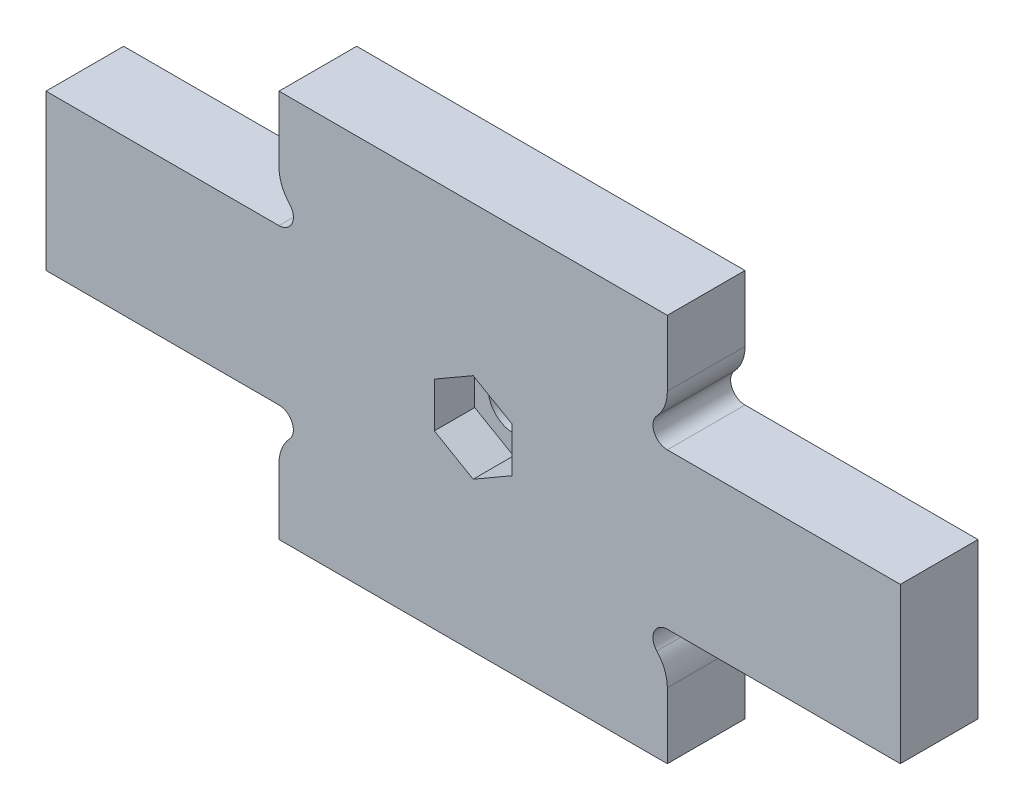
from build123d import *

# Parameters (mm, degrees)
BOSS_EXTRU_1_DEPTH      = 10
ESQUISSE3_R             = 3.25
ENL_V_MAT_EXTRU_1_DEPTH = 62.23724357
ENL_V_MAT_EXTRU_3_DEPTH = 5.2


with BuildPart() as part:
    # Esquisse1 → Boss.-Extru.1 (new body)
    with BuildSketch(Plane.XY):
        with BuildLine():
            Line((25, -10), (55, -10))
            Line((55, -10), (55, 10))
            Line((55, 10), (25, 10))
            ThreePointArc((25, 10), (23.302669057, 11.114087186), (23.649635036, 13.114521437))
            ThreePointArc((23.649635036, 13.114521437), (24.650170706, 14.694781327), (25, 16.532146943))
            Line((25, 16.532146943), (25, 25))
            Line((25, 25), (-25, 25))
            Line((-25, 25), (-25, 16.532146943))
            ThreePointArc((-25, 16.532146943), (-24.650170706, 14.694781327), (-23.649635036, 13.114521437))
            ThreePointArc((-23.649635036, 13.114521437), (-23.302669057, 11.114087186), (-25, 10))
            Line((-25, 10), (-55, 10))
            Line((-55, 10), (-55, -10))
            Line((-55, -10), (-25, -10))
            ThreePointArc((-25, -10), (-23.302669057, -11.114087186), (-23.649635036, -13.114521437))
            ThreePointArc((-23.649635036, -13.114521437), (-24.650170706, -14.694781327), (-25, -16.532146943))
            Line((-25, -16.532146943), (-25, -25))
            Line((-25, -25), (25, -25))
            Line((25, -25), (25, -16.532146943))
            ThreePointArc((25, -16.532146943), (24.650170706, -14.694781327), (23.649635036, -13.114521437))
            ThreePointArc((23.649635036, -13.114521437), (23.302669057, -11.114087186), (25, -10))
        make_face()
    extrude(amount=BOSS_EXTRU_1_DEPTH)

    # Esquisse3 → Enl_v. mat.-Extru.1 (cut, through all)
    with BuildSketch(Plane.XY.offset(10)):
        Circle(ESQUISSE3_R)
    extrude(amount=-ENL_V_MAT_EXTRU_1_DEPTH, mode=Mode.SUBTRACT)

    # Esquisse4 → Enl_v. mat.-Extru.3 (cut)
    with BuildSketch(Plane.XY.offset(10)):
        Polygon((5, -2.886751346), (5, 2.886751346), (0, 5.773502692), (-5, 2.886751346), (-5, -2.886751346), (0, -5.773502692), align=None)
    extrude(amount=-ENL_V_MAT_EXTRU_3_DEPTH, mode=Mode.SUBTRACT)


solid = part.part
